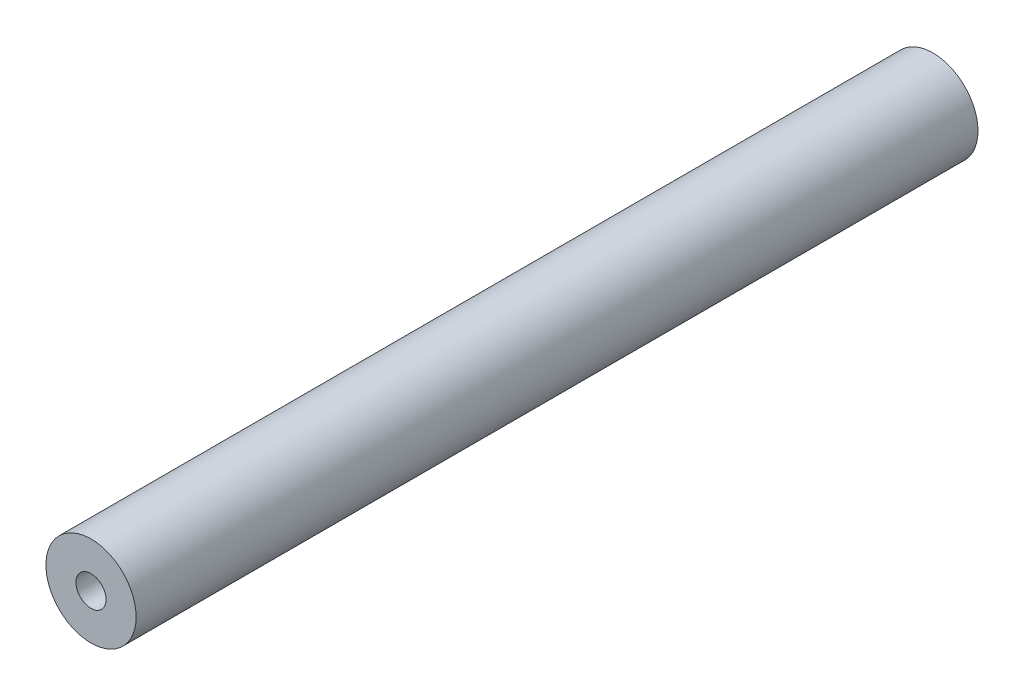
from build123d import *

# Parameters (mm, degrees)
SKETCH_1_R          = 7.5
EXTRUDE_1_DEPTH     = 140
SKETCH_2_R          = 2.5
CUT_EXTRUDE_1_DEPTH = 15
CUT_EXTRUDE_START   = -15
SKETCH_3_R          = 2.5
CUT_EXTRUDE_2_DEPTH = 15


with BuildPart() as part:
    # Sketch 1 → Extrude 1 (new body)
    with BuildSketch(Plane.XY):
        Circle(SKETCH_1_R)
    extrude(amount=EXTRUDE_1_DEPTH)

    # Sketch 2 → Cut-Extrude 1 (cut)
    with BuildSketch(Plane.XY.offset(140)):
        Circle(SKETCH_2_R)
    extrude(amount=-CUT_EXTRUDE_1_DEPTH, mode=Mode.SUBTRACT)

    # Sketch 3 → Cut-Extrude 2 (cut)
    with BuildSketch(Plane(origin=(0, 0, 0), x_dir=(-1, 0, 0), z_dir=(0, 0, -1)).offset(CUT_EXTRUDE_START)):
        with Locations(Location((0, 0, 0), (0, 0, 180))):
            Circle(SKETCH_3_R)
    extrude(amount=CUT_EXTRUDE_2_DEPTH, mode=Mode.SUBTRACT)


solid = part.part
